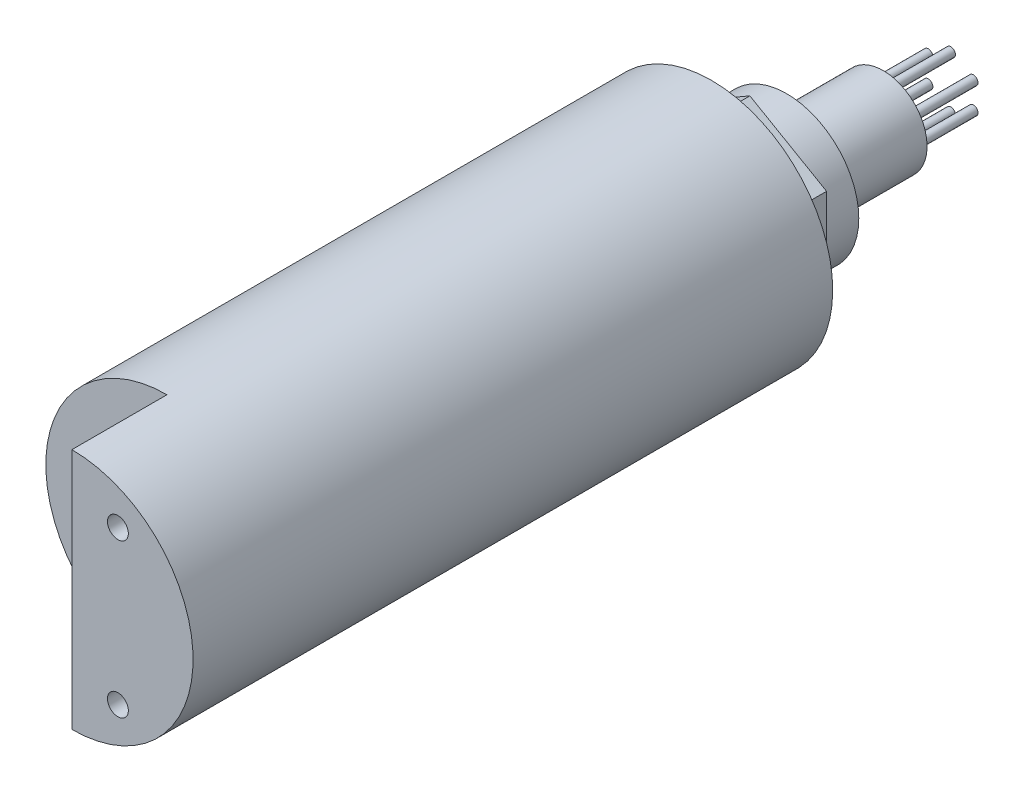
from build123d import *

# Parameters (mm, degrees)
SKETCH1_R             = 20.066
MAIN_BODY_DEPTH       = 90.17
OPTIC_FLANGE_DEPTH    = 15.748
SKETCH3_R             = 6.35
OPTIC1_DEPTH          = 0.508
SKETCH4_R             = 4.572
OPTIC2_DEPTH          = 0.508
SKETCH5_R             = 1.7272
CAP_MOUNT_HOLES_DEPTH = 6.35
UW_HEX_DEPTH          = 6.35
SKETCH7_R             = 11.938
UW_BASE_DEPTH         = 6.096
SKETCH8_R             = 7.239
UW_BORE_PLUG_DEPTH    = 16.002
SKETCH9_R             = 0.762
UW_PINS_DEPTH         = 11.176


with BuildPart() as part:
    # Sketch1 → main_body (new body)
    with BuildSketch(Plane.XY):
        Circle(SKETCH1_R)
    extrude(amount=MAIN_BODY_DEPTH)

    # Sketch2 → optic_flange (add)
    with BuildSketch(Plane.XY.offset(90.17)):
        with BuildLine():
            Line((0, 20.066), (0, -20.066))
            ThreePointArc((0, -20.066), (20.066, 0), (0, 20.066))
        make_face()
    extrude(amount=OPTIC_FLANGE_DEPTH)

    # Sketch3 → optic1 (add)
    with BuildSketch(Plane.XY.offset(90.17)):
        with Locations((-7.874, 0)):
            Circle(SKETCH3_R)
    extrude(amount=OPTIC1_DEPTH)

    # Sketch4 → optic2 (cut)
    with BuildSketch(Plane.ZY):
        with Locations((96.266, 0)):
            Circle(SKETCH4_R)
    extrude(amount=-OPTIC2_DEPTH, mode=Mode.SUBTRACT)

    # Sketch5 → cap_mount_holes (cut)
    with BuildSketch(Plane.XY.offset(105.918)):
        with Locations((7.62, 12.7)):
            Circle(SKETCH5_R)
        with Locations(Location((7.62, -12.7, 0), (0, 0, 180))):
            Circle(SKETCH5_R)
    extrude(amount=-CAP_MOUNT_HOLES_DEPTH, mode=Mode.SUBTRACT)

    # Sketch6 → uw_hex (add)
    with BuildSketch(Plane(origin=(0, 0, 0), x_dir=(-1, 0, 0), z_dir=(0, 0, -1))):
        Polygon((0, -14.664696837), (12.7, -7.332348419), (12.7, 7.332348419), (0, 14.664696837), (-12.7, 7.332348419), (-12.7, -7.332348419), align=None)
    extrude(amount=UW_HEX_DEPTH)

    # Sketch7 → uw_base (add)
    with BuildSketch(Plane(origin=(0, 0, -6.35), x_dir=(-1, 0, 0), z_dir=(0, 0, -1))):
        with Locations(Location((0, 0, 0), (0, 0, 180))):
            Circle(SKETCH7_R)
    extrude(amount=UW_BASE_DEPTH)

    # Sketch8 → uw_bore_plug (add)
    with BuildSketch(Plane(origin=(0, 0, -12.446), x_dir=(-1, 0, 0), z_dir=(0, 0, -1))):
        Circle(SKETCH8_R)
    extrude(amount=UW_BORE_PLUG_DEPTH)

    # Sketch9 → uw_pins (add)
    with BuildSketch(Plane(origin=(0, 0, -28.448), x_dir=(-1, 0, 0), z_dir=(0, 0, -1))):
        with Locations((0, 4.318)):
            Circle(SKETCH9_R)
        with Locations((3.739497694, 2.159)):
            Circle(SKETCH9_R)
        with Locations((3.739497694, -2.159)):
            Circle(SKETCH9_R)
        with Locations((0, -4.318)):
            Circle(SKETCH9_R)
        with Locations((-3.739497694, -2.159)):
            Circle(SKETCH9_R)
        with Locations((-3.739497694, 2.159)):
            Circle(SKETCH9_R)
    extrude(amount=UW_PINS_DEPTH)


solid = part.part
